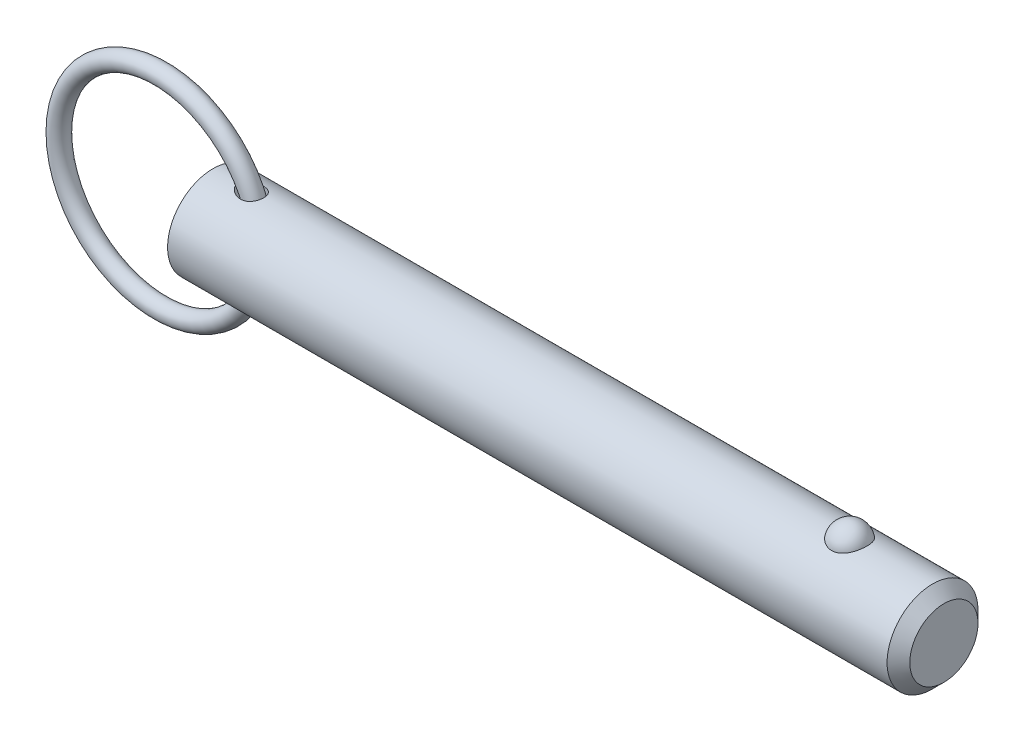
ISO-10303-21;
HEADER;
FILE_DESCRIPTION(('STEP AP214'),'2;1');
FILE_NAME('part.step','',(''),(''),'','','');
FILE_SCHEMA(('AUTOMOTIVE_DESIGN { 1 0 10303 214 1 1 1 1 }'));
ENDSEC;
DATA;
#1=APPLICATION_CONTEXT('core data for automotive mechanical design processes');
#2=APPLICATION_PROTOCOL_DEFINITION('international standard','automotive_design',2000,#1);
#3=PRODUCT_CONTEXT('',#1,'mechanical');
#4=PRODUCT('Part','Part','',(#3));
#5=PRODUCT_RELATED_PRODUCT_CATEGORY('part','',(#4));
#6=PRODUCT_DEFINITION_FORMATION('','',#4);
#7=PRODUCT_DEFINITION_CONTEXT('part definition',#1,'design');
#8=PRODUCT_DEFINITION('design','',#6,#7);
#9=PRODUCT_DEFINITION_SHAPE('','',#8);
#10=(LENGTH_UNIT() NAMED_UNIT(*) SI_UNIT(.MILLI.,.METRE.));
#11=(NAMED_UNIT(*) PLANE_ANGLE_UNIT() SI_UNIT($,.RADIAN.));
#12=(NAMED_UNIT(*) SI_UNIT($,.STERADIAN.) SOLID_ANGLE_UNIT());
#13=UNCERTAINTY_MEASURE_WITH_UNIT(LENGTH_MEASURE(1.E-05),#10,'distance_accuracy_value','');
#14=(GEOMETRIC_REPRESENTATION_CONTEXT(3) GLOBAL_UNCERTAINTY_ASSIGNED_CONTEXT((#13)) GLOBAL_UNIT_ASSIGNED_CONTEXT((#10,
#11,#12)) REPRESENTATION_CONTEXT('',''));
#15=CARTESIAN_POINT('',(0.,0.,0.));
#16=DIRECTION('',(0.,0.,1.));
#17=DIRECTION('',(1.,0.,0.));
#18=AXIS2_PLACEMENT_3D('',#15,#16,#17);
#19=CARTESIAN_POINT('',(-8.23730968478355,0.,0.));
#20=DIRECTION('',(0.,0.,1.));
#21=DIRECTION('',(1.,0.,0.));
#22=AXIS2_PLACEMENT_3D('',#19,#20,#21);
#23=TOROIDAL_SURFACE('',#22,15.875,1.422);
#24=CARTESIAN_POINT('',(9.05969031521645,0.,0.));
#25=VERTEX_POINT('',#24);
#26=VERTEX_LOOP('',#25);
#27=FACE_BOUND('',#26,.T.);
#28=ADVANCED_FACE('P0_F11',(#27),#23,.T.);
#29=CLOSED_SHELL('',(#28));
#30=MANIFOLD_SOLID_BREP('P0_B1',#29);
#31=CARTESIAN_POINT('',(0.,0.,0.));
#32=DIRECTION('',(1.,0.,0.));
#33=DIRECTION('',(0.,0.,-1.));
#34=AXIS2_PLACEMENT_3D('',#31,#32,#33);
#35=CYLINDRICAL_SURFACE('',#34,7.11);
#36=CARTESIAN_POINT('',(3.98467340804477,7.10072679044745,-0.36301383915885));
#37=CARTESIAN_POINT('',(4.00971652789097,7.09600153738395,-0.455391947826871));
#38=CARTESIAN_POINT('',(4.04401947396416,7.08958406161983,-0.545230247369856));
#39=CARTESIAN_POINT('',(4.12810160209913,7.07427055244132,-0.717157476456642));
#40=CARTESIAN_POINT('',(4.17791765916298,7.06536861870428,-0.799227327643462));
#41=CARTESIAN_POINT('',(4.28924471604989,7.04620300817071,-0.953469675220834));
#42=CARTESIAN_POINT('',(4.35063580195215,7.035953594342,-1.02573162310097));
#43=CARTESIAN_POINT('',(4.48282610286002,7.01493313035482,-1.16081412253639));
#44=CARTESIAN_POINT('',(4.55362244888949,7.00416223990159,-1.22363754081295));
#45=CARTESIAN_POINT('',(4.71659336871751,6.98090398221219,-1.35055080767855));
#46=CARTESIAN_POINT('',(4.81029272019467,6.96847103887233,-1.41269256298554));
#47=CARTESIAN_POINT('',(5.0057240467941,6.94515366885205,-1.52319699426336));
#48=CARTESIAN_POINT('',(5.10746392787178,6.93427079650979,-1.57154588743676));
#49=CARTESIAN_POINT('',(5.33503739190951,6.91346066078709,-1.66091325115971));
#50=CARTESIAN_POINT('',(5.46199550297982,6.90402388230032,-1.69921932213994));
#51=CARTESIAN_POINT('',(5.72084799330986,6.89024030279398,-1.75428261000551));
#52=CARTESIAN_POINT('',(5.85274301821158,6.88589416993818,-1.77103699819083));
#53=CARTESIAN_POINT('',(6.11557710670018,6.88337277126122,-1.78081990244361));
#54=CARTESIAN_POINT('',(6.24650031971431,6.88510489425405,-1.77420448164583));
#55=CARTESIAN_POINT('',(6.50446311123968,6.89478744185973,-1.73620392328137));
#56=CARTESIAN_POINT('',(6.6315075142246,6.90272978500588,-1.7048509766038));
#57=CARTESIAN_POINT('',(6.85933269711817,6.92243075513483,-1.62281888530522));
#58=CARTESIAN_POINT('',(6.96133251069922,6.93352131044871,-1.5753580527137));
#59=CARTESIAN_POINT('',(7.15436649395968,6.95824811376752,-1.46226310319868));
#60=CARTESIAN_POINT('',(7.24540699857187,6.97188287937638,-1.3966395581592));
#61=CARTESIAN_POINT('',(7.40446019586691,6.99838217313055,-1.25668991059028));
#62=CARTESIAN_POINT('',(7.473875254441,7.01118308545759,-1.18393777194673));
#63=CARTESIAN_POINT('',(7.59904891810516,7.03582803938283,-1.02736918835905));
#64=CARTESIAN_POINT('',(7.65481029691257,7.04767227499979,-0.943554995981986));
#65=CARTESIAN_POINT('',(7.74982438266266,7.06873077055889,-0.76979592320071));
#66=CARTESIAN_POINT('',(7.7894903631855,7.07800861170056,-0.680084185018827));
#67=CARTESIAN_POINT('',(7.85354088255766,7.09334756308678,-0.495102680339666));
#68=CARTESIAN_POINT('',(7.87792559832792,7.09940871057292,-0.399832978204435));
#69=CARTESIAN_POINT('',(7.9108898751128,7.10766731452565,-0.206294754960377));
#70=CARTESIAN_POINT('',(7.91944662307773,7.10985919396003,-0.108022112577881));
#71=CARTESIAN_POINT('',(7.920501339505,7.11012756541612,0.0886168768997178));
#72=CARTESIAN_POINT('',(7.91299895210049,7.10820396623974,0.18698322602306));
#73=CARTESIAN_POINT('',(7.88205794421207,7.10043733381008,0.38127065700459));
#74=CARTESIAN_POINT('',(7.85857985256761,7.09458459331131,0.477185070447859));
#75=CARTESIAN_POINT('',(7.79617406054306,7.07958431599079,0.663575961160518));
#76=CARTESIAN_POINT('',(7.75724672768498,7.07043685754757,0.754052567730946));
#77=CARTESIAN_POINT('',(7.66496731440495,7.04987259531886,0.926798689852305));
#78=CARTESIAN_POINT('',(7.61164530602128,7.0384605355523,1.00908483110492));
#79=CARTESIAN_POINT('',(7.49191707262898,7.01461776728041,1.16333092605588));
#80=CARTESIAN_POINT('',(7.42551210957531,7.00218715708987,1.235291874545));
#81=CARTESIAN_POINT('',(7.28164031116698,6.97770944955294,1.36680167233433));
#82=CARTESIAN_POINT('',(7.20420170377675,6.96566146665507,1.42638126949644));
#83=CARTESIAN_POINT('',(7.0403906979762,6.94319963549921,1.53199377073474));
#84=CARTESIAN_POINT('',(6.95401827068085,6.93278579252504,1.57802663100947));
#85=CARTESIAN_POINT('',(6.77318582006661,6.91444459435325,1.65656940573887));
#86=CARTESIAN_POINT('',(6.67860569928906,6.90656682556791,1.68881327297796));
#87=CARTESIAN_POINT('',(6.48544119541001,6.89422806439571,1.73849768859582));
#88=CARTESIAN_POINT('',(6.38685561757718,6.88976809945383,1.755933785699));
#89=CARTESIAN_POINT('',(6.18089829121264,6.88429907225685,1.77726234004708));
#90=CARTESIAN_POINT('',(6.07340937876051,6.88356485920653,1.78007646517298));
#91=CARTESIAN_POINT('',(5.85921220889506,6.886086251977,1.77029087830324));
#92=CARTESIAN_POINT('',(5.75250426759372,6.88934339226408,1.75768523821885));
#93=CARTESIAN_POINT('',(5.52848027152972,6.89994454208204,1.71563399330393));
#94=CARTESIAN_POINT('',(5.41155168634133,6.90775772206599,1.68424184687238));
#95=CARTESIAN_POINT('',(5.18376466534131,6.92670168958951,1.60454711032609));
#96=CARTESIAN_POINT('',(5.07291446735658,6.9378368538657,1.5562221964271));
#97=CARTESIAN_POINT('',(4.84835244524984,6.96347168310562,1.43744827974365));
#98=CARTESIAN_POINT('',(4.73562531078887,6.97820486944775,1.36517310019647));
#99=CARTESIAN_POINT('',(4.52504912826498,7.00822340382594,1.20158053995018));
#100=CARTESIAN_POINT('',(4.42717478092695,7.02350775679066,1.11029618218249));
#101=CARTESIAN_POINT('',(4.27935716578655,7.04784659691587,0.940654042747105));
#102=CARTESIAN_POINT('',(4.2239722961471,7.05736064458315,0.867099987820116));
#103=CARTESIAN_POINT('',(4.12558347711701,7.07469854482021,0.711919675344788));
#104=CARTESIAN_POINT('',(4.08256922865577,7.0825238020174,0.630300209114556));
#105=CARTESIAN_POINT('',(4.01142860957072,7.09565978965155,0.459428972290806));
#106=CARTESIAN_POINT('',(3.98346043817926,7.10094374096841,0.370107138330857));
#107=CARTESIAN_POINT('',(3.95517285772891,7.1063173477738,0.2333583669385));
#108=CARTESIAN_POINT('',(3.94802115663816,7.1076831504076,0.187321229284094));
#109=CARTESIAN_POINT('',(3.93842121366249,7.10951900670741,0.0947476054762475));
#110=CARTESIAN_POINT('',(3.93597129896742,7.10998937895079,0.0482113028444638));
#111=CARTESIAN_POINT('',(3.93584361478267,7.11001358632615,-0.0598597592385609));
#112=CARTESIAN_POINT('',(3.9399538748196,7.10922402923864,-0.121405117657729));
#113=CARTESIAN_POINT('',(3.95632793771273,7.10609781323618,-0.243320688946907));
#114=CARTESIAN_POINT('',(3.96859135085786,7.10376122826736,-0.303690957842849));
#115=CARTESIAN_POINT('',(3.98467340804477,7.10072679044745,-0.36301383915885));
#116=B_SPLINE_CURVE_WITH_KNOTS('',3,(#36,#37,#38,#39,#40,#41,#42,#43,#44,#45,#46,#47,#48,#49,
#50,#51,#52,#53,#54,#55,#56,#57,#58,#59,#60,#61,#62,#63,#64,#65,#66,#67,#68,#69,#70,#71,#72,#73,
#74,#75,#76,#77,#78,#79,#80,#81,#82,#83,#84,#85,#86,#87,#88,#89,#90,#91,#92,#93,#94,#95,#96,#97,
#98,#99,#100,#101,#102,#103,#104,#105,#106,#107,#108,#109,#110,#111,#112,#113,#114,#115),
.UNSPECIFIED.,.T.,.F.,(4,2,2,2,2,2,2,2,2,2,2,2,2,2,2,2,2,2,2,2,2,2,2,2,2,2,2,2,2,2,2,2,2,2,2,2,
2,2,2,4),(0.,0.287206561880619,0.575101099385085,0.860162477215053,1.14513709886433,
1.48324846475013,1.82169652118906,2.21865672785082,2.6156690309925,3.00665870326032,
3.39714041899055,3.73437585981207,4.07141541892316,4.37402271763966,4.67656849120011,
4.97076150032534,5.26495110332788,5.55956439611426,5.85418421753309,6.14953461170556,
6.44487798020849,6.73960905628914,7.03431171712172,7.32827352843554,7.6222362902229,
7.9216396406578,8.22113296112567,8.54242840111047,8.86384740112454,9.22635035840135,
9.58933304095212,9.99153142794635,10.3930368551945,10.6697219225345,10.9461759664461,
11.2254825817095,11.3650959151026,11.5046595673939,11.6891051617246,11.8735419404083),.UNSPECIFIED.);
#117=CARTESIAN_POINT('',(3.98467340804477,7.10072679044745,-0.36301383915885));
#118=VERTEX_POINT('',#117);
#119=EDGE_CURVE('P1_E40',#118,#118,#116,.T.);
#120=ORIENTED_EDGE('',*,*,#119,.T.);
#121=EDGE_LOOP('',(#120));
#122=FACE_BOUND('',#121,.T.);
#123=CARTESIAN_POINT('',(112.4925,0.,0.));
#124=DIRECTION('',(1.,0.,0.));
#125=DIRECTION('',(0.,0.,-1.));
#126=AXIS2_PLACEMENT_3D('',#123,#124,#125);
#127=CIRCLE('',#126,7.11);
#128=CARTESIAN_POINT('',(112.4925,0.,-7.11));
#129=VERTEX_POINT('',#128);
#130=EDGE_CURVE('P1_E25',#129,#129,#127,.T.);
#131=ORIENTED_EDGE('',*,*,#130,.F.);
#132=EDGE_LOOP('',(#131));
#133=FACE_BOUND('',#132,.T.);
#134=CARTESIAN_POINT('',(0.,0.,0.));
#135=DIRECTION('',(1.,0.,0.));
#136=DIRECTION('',(0.,0.,-1.));
#137=AXIS2_PLACEMENT_3D('',#134,#135,#136);
#138=CIRCLE('',#137,7.11);
#139=CARTESIAN_POINT('',(0.,0.,-7.11));
#140=VERTEX_POINT('',#139);
#141=EDGE_CURVE('P1_E9',#140,#140,#138,.T.);
#142=ORIENTED_EDGE('',*,*,#141,.T.);
#143=EDGE_LOOP('',(#142));
#144=FACE_BOUND('',#143,.T.);
#145=CARTESIAN_POINT('',(99.529258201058,6.53646663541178,2.79762469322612));
#146=CARTESIAN_POINT('',(99.3844296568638,6.53647876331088,2.79761243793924));
#147=CARTESIAN_POINT('',(99.239368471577,6.54144531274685,2.78608115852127));
#148=CARTESIAN_POINT('',(98.9532920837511,6.56077791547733,2.74023282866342));
#149=CARTESIAN_POINT('',(98.8122884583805,6.57516852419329,2.70585624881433));
#150=CARTESIAN_POINT('',(98.5388833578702,6.61165072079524,2.61544042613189));
#151=CARTESIAN_POINT('',(98.4064602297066,6.63372195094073,2.55945840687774));
#152=CARTESIAN_POINT('',(98.1532337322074,6.68316012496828,2.42742958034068));
#153=CARTESIAN_POINT('',(98.0324254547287,6.71052481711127,2.35139129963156));
#154=CARTESIAN_POINT('',(97.8016372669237,6.76860821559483,2.17866150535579));
#155=CARTESIAN_POINT('',(97.6920857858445,6.79940242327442,2.08142342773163));
#156=CARTESIAN_POINT('',(97.4903340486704,6.86050242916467,1.87020907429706));
#157=CARTESIAN_POINT('',(97.3981390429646,6.89080807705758,1.75622775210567));
#158=CARTESIAN_POINT('',(97.2292547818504,6.94923069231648,1.50900646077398));
#159=CARTESIAN_POINT('',(97.1534289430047,6.97719213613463,1.37513873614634));
#160=CARTESIAN_POINT('',(97.0242063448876,7.02647251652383,1.09584817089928));
#161=CARTESIAN_POINT('',(96.9708109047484,7.04779106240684,0.950424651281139));
#162=CARTESIAN_POINT('',(96.8871019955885,7.08180248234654,0.650508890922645));
#163=CARTESIAN_POINT('',(96.8570253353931,7.09440672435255,0.495940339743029));
#164=CARTESIAN_POINT('',(96.821473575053,7.10935121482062,0.183515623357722));
#165=CARTESIAN_POINT('',(96.8159974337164,7.11169189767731,0.025659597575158));
#166=CARTESIAN_POINT('',(96.829700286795,7.10589702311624,-0.287512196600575));
#167=CARTESIAN_POINT('',(96.8486823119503,7.0978451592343,-0.442838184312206));
#168=CARTESIAN_POINT('',(96.9105745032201,7.07221860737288,-0.747830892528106));
#169=CARTESIAN_POINT('',(96.9534850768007,7.05464375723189,-0.897497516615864));
#170=CARTESIAN_POINT('',(97.0624527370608,7.01171031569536,-1.1872286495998));
#171=CARTESIAN_POINT('',(97.1285458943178,6.98633960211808,-1.32727778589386));
#172=CARTESIAN_POINT('',(97.2825362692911,6.93042258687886,-1.59370324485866));
#173=CARTESIAN_POINT('',(97.3704355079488,6.89987580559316,-1.72007829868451));
#174=CARTESIAN_POINT('',(97.5669269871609,6.83659510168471,-1.95657345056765));
#175=CARTESIAN_POINT('',(97.6756640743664,6.80384697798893,-2.0665695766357));
#176=CARTESIAN_POINT('',(97.9109686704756,6.7400183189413,-2.26611005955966));
#177=CARTESIAN_POINT('',(98.0375350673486,6.70893767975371,-2.35565569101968));
#178=CARTESIAN_POINT('',(98.3028454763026,6.65264442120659,-2.51019726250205));
#179=CARTESIAN_POINT('',(98.4413230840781,6.62733449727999,-2.5756139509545));
#180=CARTESIAN_POINT('',(98.7285194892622,6.58495995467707,-2.6821113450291));
#181=CARTESIAN_POINT('',(98.8772343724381,6.56789220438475,-2.72320129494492));
#182=CARTESIAN_POINT('',(99.1726268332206,6.54478663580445,-2.77825810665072));
#183=CARTESIAN_POINT('',(99.3190295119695,6.53823639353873,-2.7934872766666));
#184=CARTESIAN_POINT('',(99.6124700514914,6.53532718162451,-2.80028921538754));
#185=CARTESIAN_POINT('',(99.7595077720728,6.53896606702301,-2.79186696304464));
#186=CARTESIAN_POINT('',(100.044921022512,6.55570357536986,-2.75232178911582));
#187=CARTESIAN_POINT('',(100.183422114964,6.56848455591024,-2.72196077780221));
#188=CARTESIAN_POINT('',(100.453114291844,6.60173528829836,-2.64028774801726));
#189=CARTESIAN_POINT('',(100.584304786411,6.62220565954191,-2.58897404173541));
#190=CARTESIAN_POINT('',(100.838846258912,6.6691792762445,-2.46547820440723));
#191=CARTESIAN_POINT('',(100.961969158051,6.69580233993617,-2.39287266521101));
#192=CARTESIAN_POINT('',(101.194441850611,6.75207041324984,-2.22915269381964));
#193=CARTESIAN_POINT('',(101.303788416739,6.78171612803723,-2.13803393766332));
#194=CARTESIAN_POINT('',(101.511642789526,6.8426462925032,-1.93445592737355));
#195=CARTESIAN_POINT('',(101.609317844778,6.87393748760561,-1.82114774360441));
#196=CARTESIAN_POINT('',(101.785011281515,6.93345710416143,-1.5794778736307));
#197=CARTESIAN_POINT('',(101.863026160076,6.96168497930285,-1.45111351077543));
#198=CARTESIAN_POINT('',(101.999985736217,7.01307558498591,-1.17842708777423));
#199=CARTESIAN_POINT('',(102.058258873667,7.03605262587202,-1.03373189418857));
#200=CARTESIAN_POINT('',(102.151081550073,7.07340932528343,-0.735867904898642));
#201=CARTESIAN_POINT('',(102.185631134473,7.08778900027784,-0.582699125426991));
#202=CARTESIAN_POINT('',(102.230274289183,7.10647639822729,-0.272420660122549));
#203=CARTESIAN_POINT('',(102.24039710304,7.11079616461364,-0.115315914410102));
#204=CARTESIAN_POINT('',(102.236061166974,7.10896059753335,0.198488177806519));
#205=CARTESIAN_POINT('',(102.221603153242,7.10280557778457,0.355187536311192));
#206=CARTESIAN_POINT('',(102.168572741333,7.08071500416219,0.662724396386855));
#207=CARTESIAN_POINT('',(102.13015058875,7.06484039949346,0.813592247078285));
#208=CARTESIAN_POINT('',(102.030101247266,7.0249589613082,1.10629159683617));
#209=CARTESIAN_POINT('',(101.968472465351,7.00095156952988,1.24812247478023));
#210=CARTESIAN_POINT('',(101.822766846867,6.94706632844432,1.51976439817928));
#211=CARTESIAN_POINT('',(101.738544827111,6.91715085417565,1.6494901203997));
#212=CARTESIAN_POINT('',(101.549586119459,6.85470565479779,1.89231285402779));
#213=CARTESIAN_POINT('',(101.444850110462,6.82217601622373,2.0054104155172));
#214=CARTESIAN_POINT('',(101.217103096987,6.75805358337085,2.21190674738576));
#215=CARTESIAN_POINT('',(101.094082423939,6.72646129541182,2.30529503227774));
#216=CARTESIAN_POINT('',(100.83273470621,6.66789520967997,2.4695990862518));
#217=CARTESIAN_POINT('',(100.694401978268,6.64092313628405,2.5405064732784));
#218=CARTESIAN_POINT('',(100.411182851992,6.5957258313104,2.65560045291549));
#219=CARTESIAN_POINT('',(100.266666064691,6.57724013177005,2.7005953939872));
#220=CARTESIAN_POINT('',(99.9715469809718,6.55006426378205,2.76587321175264));
#221=CARTESIAN_POINT('',(99.8209640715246,6.54134511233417,2.78622922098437));
#222=CARTESIAN_POINT('',(99.6230463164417,6.53697847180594,2.79642434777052));
#223=CARTESIAN_POINT('',(99.5761644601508,6.53646270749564,2.79762866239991));
#224=CARTESIAN_POINT('',(99.529258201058,6.53646663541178,2.79762469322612));
#225=B_SPLINE_CURVE_WITH_KNOTS('',3,(#145,#146,#147,#148,#149,#150,#151,#152,#153,#154,#155,
#156,#157,#158,#159,#160,#161,#162,#163,#164,#165,#166,#167,#168,#169,#170,#171,#172,#173,#174,
#175,#176,#177,#178,#179,#180,#181,#182,#183,#184,#185,#186,#187,#188,#189,#190,#191,#192,#193,
#194,#195,#196,#197,#198,#199,#200,#201,#202,#203,#204,#205,#206,#207,#208,#209,#210,#211,#212,
#213,#214,#215,#216,#217,#218,#219,#220,#221,#222,#223,#224),.UNSPECIFIED.,.T.,.F.,(4,2,2,2,2,2,
2,2,2,2,2,2,2,2,2,2,2,2,2,2,2,2,2,2,2,2,2,2,2,2,2,2,2,2,2,2,2,2,2,4),(0.,0.434355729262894,
0.86984774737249,1.30419416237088,1.73835621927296,2.18541922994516,2.63261726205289,
3.09954261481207,3.56649542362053,4.03813031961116,4.50974525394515,4.97758575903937,
5.4454342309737,5.91401389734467,6.38263700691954,6.85464418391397,7.32662193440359,
7.78992971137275,8.25306131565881,8.69285754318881,9.13256119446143,9.5576862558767,
9.98284556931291,10.4171106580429,10.851477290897,11.3079089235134,11.7644218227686,
12.2351898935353,12.7059570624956,13.1761603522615,13.6463495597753,14.1136200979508,
14.5809227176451,15.0513032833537,15.5216682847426,15.9922828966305,16.4630727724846,
16.9182457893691,17.3720644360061,17.5127411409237),.UNSPECIFIED.);
#226=CARTESIAN_POINT('',(99.529258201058,6.53646663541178,2.79762469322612));
#227=VERTEX_POINT('',#226);
#228=EDGE_CURVE('P1_E34',#227,#227,#225,.T.);
#229=ORIENTED_EDGE('',*,*,#228,.T.);
#230=EDGE_LOOP('',(#229));
#231=FACE_BOUND('',#230,.T.);
#232=CARTESIAN_POINT('',(3.98467340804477,-7.10072679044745,-0.36301383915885));
#233=CARTESIAN_POINT('',(3.96426456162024,-7.10457733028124,-0.28771410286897));
#234=CARTESIAN_POINT('',(3.95000501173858,-7.10730349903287,-0.210695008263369));
#235=CARTESIAN_POINT('',(3.93481801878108,-7.11020840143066,-0.0553038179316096));
#236=CARTESIAN_POINT('',(3.93388435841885,-7.11038832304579,0.0230676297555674));
#237=CARTESIAN_POINT('',(3.94541910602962,-7.10817995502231,0.1787147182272));
#238=CARTESIAN_POINT('',(3.95787987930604,-7.10579312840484,0.255990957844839));
#239=CARTESIAN_POINT('',(3.99523775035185,-7.09872642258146,0.407352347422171));
#240=CARTESIAN_POINT('',(4.02014065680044,-7.09404547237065,0.481435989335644));
#241=CARTESIAN_POINT('',(4.08119600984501,-7.08278363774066,0.62577562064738));
#242=CARTESIAN_POINT('',(4.11749458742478,-7.07617815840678,0.695967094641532));
#243=CARTESIAN_POINT('',(4.19940836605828,-7.06165305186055,0.830508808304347));
#244=CARTESIAN_POINT('',(4.24502952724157,-7.0537325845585,0.894855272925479));
#245=CARTESIAN_POINT('',(4.36790232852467,-7.03310314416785,1.04688574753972));
#246=CARTESIAN_POINT('',(4.44977459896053,-7.01993229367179,1.13078695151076));
#247=CARTESIAN_POINT('',(4.62610796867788,-6.99351259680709,1.28411726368));
#248=CARTESIAN_POINT('',(4.7205898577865,-6.98026365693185,1.35352197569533));
#249=CARTESIAN_POINT('',(4.92036507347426,-6.9549104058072,1.47831921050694));
#250=CARTESIAN_POINT('',(5.02579054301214,-6.94282458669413,1.53350332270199));
#251=CARTESIAN_POINT('',(5.24378330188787,-6.92129098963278,1.62793610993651));
#252=CARTESIAN_POINT('',(5.35635066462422,-6.91184323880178,1.66718462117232));
#253=CARTESIAN_POINT('',(5.60134354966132,-6.89573491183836,1.73269893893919));
#254=CARTESIAN_POINT('',(5.73444697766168,-6.8895970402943,1.75661057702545));
#255=CARTESIAN_POINT('',(6.00300738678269,-6.88344616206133,1.78057487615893));
#256=CARTESIAN_POINT('',(6.13846360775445,-6.88343121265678,1.78063510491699));
#257=CARTESIAN_POINT('',(6.39660470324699,-6.88981379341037,1.75576480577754));
#258=CARTESIAN_POINT('',(6.51947843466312,-6.89572457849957,1.73273121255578));
#259=CARTESIAN_POINT('',(6.75813770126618,-6.91274434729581,1.66352936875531));
#260=CARTESIAN_POINT('',(6.87393155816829,-6.92384709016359,1.61738888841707));
#261=CARTESIAN_POINT('',(7.07801861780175,-6.94787316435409,1.51052664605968));
#262=CARTESIAN_POINT('',(7.16789841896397,-6.96033024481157,1.45271574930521));
#263=CARTESIAN_POINT('',(7.33546773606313,-6.98638661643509,1.32171912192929));
#264=CARTESIAN_POINT('',(7.41316182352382,-6.99998547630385,1.24853918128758));
#265=CARTESIAN_POINT('',(7.54861420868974,-7.02559503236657,1.09486170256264));
#266=CARTESIAN_POINT('',(7.60741145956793,-7.03764930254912,1.01528346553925));
#267=CARTESIAN_POINT('',(7.71070740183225,-7.0598657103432,0.847099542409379));
#268=CARTESIAN_POINT('',(7.75520788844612,-7.0700280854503,0.758494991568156));
#269=CARTESIAN_POINT('',(7.82836147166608,-7.08722075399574,0.575936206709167));
#270=CARTESIAN_POINT('',(7.85719783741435,-7.09428707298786,0.482058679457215));
#271=CARTESIAN_POINT('',(7.89918378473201,-7.10470260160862,0.29065874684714));
#272=CARTESIAN_POINT('',(7.91233308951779,-7.10805174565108,0.193136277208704));
#273=CARTESIAN_POINT('',(7.92267451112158,-7.11067890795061,-0.00313968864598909));
#274=CARTESIAN_POINT('',(7.91981203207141,-7.10994299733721,-0.101896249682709));
#275=CARTESIAN_POINT('',(7.89806489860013,-7.10444651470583,-0.297516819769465));
#276=CARTESIAN_POINT('',(7.87918005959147,-7.09968589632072,-0.394380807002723));
#277=CARTESIAN_POINT('',(7.82577988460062,-7.0866471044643,-0.583553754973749));
#278=CARTESIAN_POINT('',(7.79124976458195,-7.07836560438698,-0.675858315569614));
#279=CARTESIAN_POINT('',(7.70736343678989,-7.05919003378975,-0.853167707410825));
#280=CARTESIAN_POINT('',(7.65800801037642,-7.04829610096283,-0.938172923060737));
#281=CARTESIAN_POINT('',(7.54590141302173,-7.02513961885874,-1.09819812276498));
#282=CARTESIAN_POINT('',(7.48319521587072,-7.01288172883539,-1.17325029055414));
#283=CARTESIAN_POINT('',(7.34599775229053,-6.98832192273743,-1.31164333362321));
#284=CARTESIAN_POINT('',(7.27150757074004,-6.97602001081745,-1.37498528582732));
#285=CARTESIAN_POINT('',(7.11277776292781,-6.95268608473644,-1.48849974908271));
#286=CARTESIAN_POINT('',(7.02852525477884,-6.94165578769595,-1.53865456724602));
#287=CARTESIAN_POINT('',(6.85282430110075,-6.92200320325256,-1.62478650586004));
#288=CARTESIAN_POINT('',(6.76137511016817,-6.91338116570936,-1.66076215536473));
#289=CARTESIAN_POINT('',(6.57061179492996,-6.89906044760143,-1.71930563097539));
#290=CARTESIAN_POINT('',(6.4711351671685,-6.89347290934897,-1.74136795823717));
#291=CARTESIAN_POINT('',(6.26989833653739,-6.88605020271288,-1.7704895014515));
#292=CARTESIAN_POINT('',(6.16813737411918,-6.88421630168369,-1.77754365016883));
#293=CARTESIAN_POINT('',(5.95492537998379,-6.88424071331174,-1.77745174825));
#294=CARTESIAN_POINT('',(5.8434768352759,-6.88646827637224,-1.76888555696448));
#295=CARTESIAN_POINT('',(5.62307560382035,-6.89483827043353,-1.73596677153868));
#296=CARTESIAN_POINT('',(5.51412477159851,-6.90098351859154,-1.71160281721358));
#297=CARTESIAN_POINT('',(5.28644478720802,-6.91743803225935,-1.64393691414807));
#298=CARTESIAN_POINT('',(5.16837217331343,-6.92819628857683,-1.59852806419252));
#299=CARTESIAN_POINT('',(4.94091825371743,-6.95234836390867,-1.4899796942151));
#300=CARTESIAN_POINT('',(4.83153887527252,-6.96574276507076,-1.42683625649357));
#301=CARTESIAN_POINT('',(4.63576710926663,-6.99209234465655,-1.29112257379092));
#302=CARTESIAN_POINT('',(4.54816728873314,-7.00494184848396,-1.22027748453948));
#303=CARTESIAN_POINT('',(4.3855489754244,-7.03019055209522,-1.0652111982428));
#304=CARTESIAN_POINT('',(4.31052141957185,-7.04259007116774,-0.980999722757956));
#305=CARTESIAN_POINT('',(4.18551811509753,-7.0640229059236,-0.811206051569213));
#306=CARTESIAN_POINT('',(4.13358417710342,-7.07328321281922,-0.727107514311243));
#307=CARTESIAN_POINT('',(4.04607461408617,-7.0891994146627,-0.55058028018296));
#308=CARTESIAN_POINT('',(4.01046401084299,-7.09586087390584,-0.458169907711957));
#309=CARTESIAN_POINT('',(3.98467340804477,-7.10072679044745,-0.36301383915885));
#310=B_SPLINE_CURVE_WITH_KNOTS('',3,(#232,#233,#234,#235,#236,#237,#238,#239,#240,#241,#242,
#243,#244,#245,#246,#247,#248,#249,#250,#251,#252,#253,#254,#255,#256,#257,#258,#259,#260,#261,
#262,#263,#264,#265,#266,#267,#268,#269,#270,#271,#272,#273,#274,#275,#276,#277,#278,#279,#280,
#281,#282,#283,#284,#285,#286,#287,#288,#289,#290,#291,#292,#293,#294,#295,#296,#297,#298,#299,
#300,#301,#302,#303,#304,#305,#306,#307,#308,#309),.UNSPECIFIED.,.T.,.F.,(4,2,2,2,2,2,2,2,2,2,2,
2,2,2,2,2,2,2,2,2,2,2,2,2,2,2,2,2,2,2,2,2,2,2,2,2,2,2,4),(0.,0.234020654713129,
0.467932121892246,0.701710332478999,0.935597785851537,1.17261620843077,1.4097866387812,
1.76177576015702,2.11435255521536,2.47183528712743,2.8293216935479,3.23332937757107,
3.63720887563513,4.01042610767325,4.38319587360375,4.70425151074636,5.02518641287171,
5.32277979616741,5.62033579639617,5.91433101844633,6.2083314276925,6.50333490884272,
6.79834178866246,7.09362801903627,7.38889868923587,7.6831900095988,7.9774542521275,
8.27211131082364,8.566798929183,8.8716552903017,9.17661456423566,9.51069129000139,
9.84500851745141,10.2243046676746,10.6036846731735,10.9425776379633,11.2812252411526,
11.5775945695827,11.8733258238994),.UNSPECIFIED.);
#311=CARTESIAN_POINT('',(3.98467340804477,-7.10072679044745,-0.36301383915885));
#312=VERTEX_POINT('',#311);
#313=EDGE_CURVE('P1_E17',#312,#312,#310,.T.);
#314=ORIENTED_EDGE('',*,*,#313,.T.);
#315=EDGE_LOOP('',(#314));
#316=FACE_BOUND('',#315,.T.);
#317=ADVANCED_FACE('P1_F13',(#122,#133,#144,#231,#316),#35,.T.);
#318=CARTESIAN_POINT('',(0.,0.,0.));
#319=DIRECTION('',(-1.,0.,0.));
#320=DIRECTION('',(0.,0.,1.));
#321=AXIS2_PLACEMENT_3D('',#318,#319,#320);
#322=PLANE('',#321);
#323=ORIENTED_EDGE('',*,*,#141,.F.);
#324=EDGE_LOOP('',(#323));
#325=FACE_BOUND('',#324,.T.);
#326=ADVANCED_FACE('P1_F15',(#325),#322,.T.);
#327=CARTESIAN_POINT('',(114.27,0.,0.));
#328=DIRECTION('',(-1.,0.,0.));
#329=DIRECTION('',(0.,0.,1.));
#330=AXIS2_PLACEMENT_3D('',#327,#328,#329);
#331=CONICAL_SURFACE('',#330,5.33250000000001,0.785398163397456);
#332=ORIENTED_EDGE('',*,*,#130,.T.);
#333=EDGE_LOOP('',(#332));
#334=FACE_BOUND('',#333,.T.);
#335=CARTESIAN_POINT('',(114.27,0.,0.));
#336=DIRECTION('',(1.,0.,0.));
#337=DIRECTION('',(0.,0.,-1.));
#338=AXIS2_PLACEMENT_3D('',#335,#336,#337);
#339=CIRCLE('',#338,5.33250000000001);
#340=CARTESIAN_POINT('',(114.27,0.,-5.33250000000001));
#341=VERTEX_POINT('',#340);
#342=EDGE_CURVE('P1_E30',#341,#341,#339,.T.);
#343=ORIENTED_EDGE('',*,*,#342,.F.);
#344=EDGE_LOOP('',(#343));
#345=FACE_BOUND('',#344,.T.);
#346=ADVANCED_FACE('P1_F55',(#334,#345),#331,.T.);
#347=CARTESIAN_POINT('',(114.27,5.33250000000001,0.));
#348=DIRECTION('',(1.,0.,0.));
#349=DIRECTION('',(0.,0.,-1.));
#350=AXIS2_PLACEMENT_3D('',#347,#348,#349);
#351=PLANE('',#350);
#352=ORIENTED_EDGE('',*,*,#342,.T.);
#353=EDGE_LOOP('',(#352));
#354=FACE_BOUND('',#353,.T.);
#355=ADVANCED_FACE('P1_F51',(#354),#351,.T.);
#356=CARTESIAN_POINT('',(99.529258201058,6.39899999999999,0.));
#357=DIRECTION('',(-1.,0.,0.));
#358=DIRECTION('',(0.,1.,0.));
#359=AXIS2_PLACEMENT_3D('',#356,#357,#358);
#360=SPHERICAL_SURFACE('',#359,2.801);
#361=ORIENTED_EDGE('',*,*,#228,.F.);
#362=EDGE_LOOP('',(#361));
#363=FACE_BOUND('',#362,.T.);
#364=ADVANCED_FACE('P1_F46',(#363),#360,.T.);
#365=CARTESIAN_POINT('',(-8.23730968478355,0.,0.));
#366=DIRECTION('',(0.,0.,1.));
#367=DIRECTION('',(1.,0.,0.));
#368=AXIS2_PLACEMENT_3D('',#365,#366,#367);
#369=TOROIDAL_SURFACE('',#368,15.875,1.7775);
#370=ORIENTED_EDGE('',*,*,#313,.F.);
#371=EDGE_LOOP('',(#370));
#372=FACE_BOUND('',#371,.T.);
#373=ORIENTED_EDGE('',*,*,#119,.F.);
#374=EDGE_LOOP('',(#373));
#375=FACE_BOUND('',#374,.T.);
#376=ADVANCED_FACE('P1_F50',(#372,#375),#369,.F.);
#377=CLOSED_SHELL('',(#317,#326,#346,#355,#364,#376));
#378=MANIFOLD_SOLID_BREP('P1_B1',#377);
#379=ADVANCED_BREP_SHAPE_REPRESENTATION('',(#18,#30,#378),#14);
#380=SHAPE_DEFINITION_REPRESENTATION(#9,#379);
ENDSEC;
END-ISO-10303-21;
